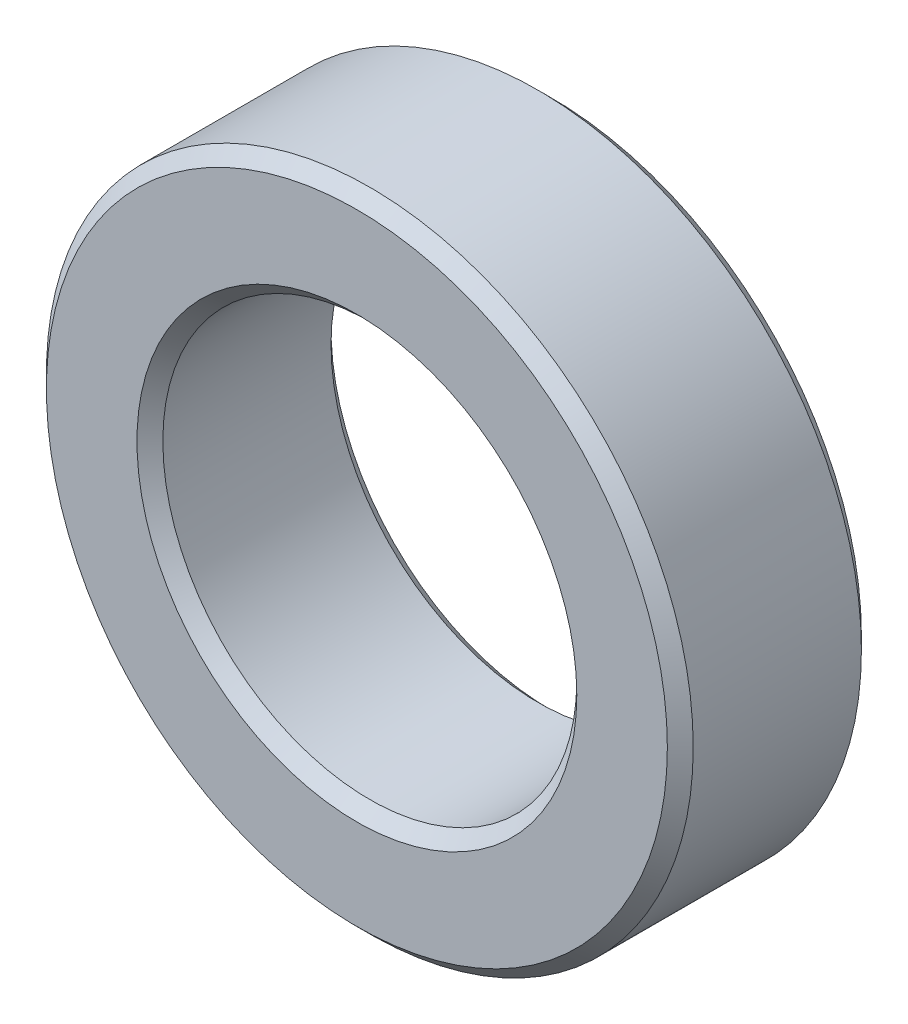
from build123d import *

# Parameters (mm, degrees)
SKETCH1_R           = 5
SKETCH1_R_2         = 3.2
BOSS_EXTRUDE2_DEPTH = 1.5
CHAMFER3_SIZE       = 0.2


with BuildPart() as part:
    # Sketch1 → Boss-Extrude2 (new, symmetric)
    with BuildSketch(Plane.XY):
        Circle(SKETCH1_R)
        Circle(SKETCH1_R_2, mode=Mode.SUBTRACT)
    extrude(amount=BOSS_EXTRUDE2_DEPTH, both=True)

    # Chamfer3
    chamfer3_edges = [part.edges().sort_by_distance(p)[0] for p in [
        (-5, 0, -1.5),
        (-5, 0, 1.5),
        (-3.2, 0, -1.5),
        (-3.2, 0, 1.5),
    ]]
    chamfer(chamfer3_edges, length=CHAMFER3_SIZE)


solid = part.part
